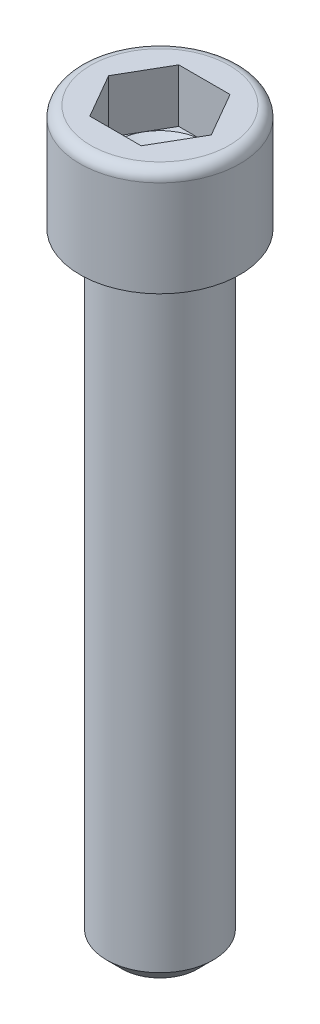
from build123d import *

# Parameters (mm, degrees)
TIGE_START              = -70
ESQUISSE1_R             = 6
TIGE_DEPTH              = 70
CHANFREIN_D_ENTR_E_SIZE = 1.75
HEXAGONE_DEPTH          = 6


with BuildPart() as part:
    # Esquisse1 → Tige (new body)
    with BuildSketch(Plane(origin=(0, 0, 0), x_dir=(1, 0, 0), z_dir=(0, 1, 0)).offset(TIGE_START)):
        with Locations(Location((0, 0, 0), (0, 0, 270))):
            Circle(ESQUISSE1_R)
    extrude(amount=TIGE_DEPTH)

    # Chanfrein d_entr_e
    chanfrein_d_entr_e_edges = [part.edges().sort_by_distance(p)[0] for p in [
        (0, -70, -6),
    ]]
    chamfer(chanfrein_d_entr_e_edges, length=CHANFREIN_D_ENTR_E_SIZE)

    # Esquisse2 → T_te (revolve)
    with BuildSketch(Plane.XY, mode=Mode.PRIVATE) as t_te_sk:
        with BuildLine():
            Line((5, 12), (5, 6))
            Line((5, 6), (0, 3.113248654))
            Line((0, 3.113248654), (0, 0))
            Line((0, 0), (9, 0))
            Line((9, 0), (9, 10.8))
            ThreePointArc((9, 10.8), (8.648528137, 11.648528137), (7.8, 12))
            Line((7.8, 12), (5, 12))
        make_face()
    revolve(t_te_sk.sketch.rotate(Axis((0, 12, 0), (0, -1, 0)), 180), axis=Axis((0, 12, 0), (0, -1, 0)))

    # Esquisse3 → Hexagone (cut)
    with BuildSketch(Plane(origin=(0, 12, -3), x_dir=(1, 0, 0), z_dir=(0, -1, 0))):
        Polygon((2.886751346, 8), (-2.886751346, 8), (-5.773502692, 3), (-2.886751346, -2), (2.886751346, -2), (5.773502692, 3), align=None)
    extrude(amount=HEXAGONE_DEPTH, mode=Mode.SUBTRACT)


solid = part.part
